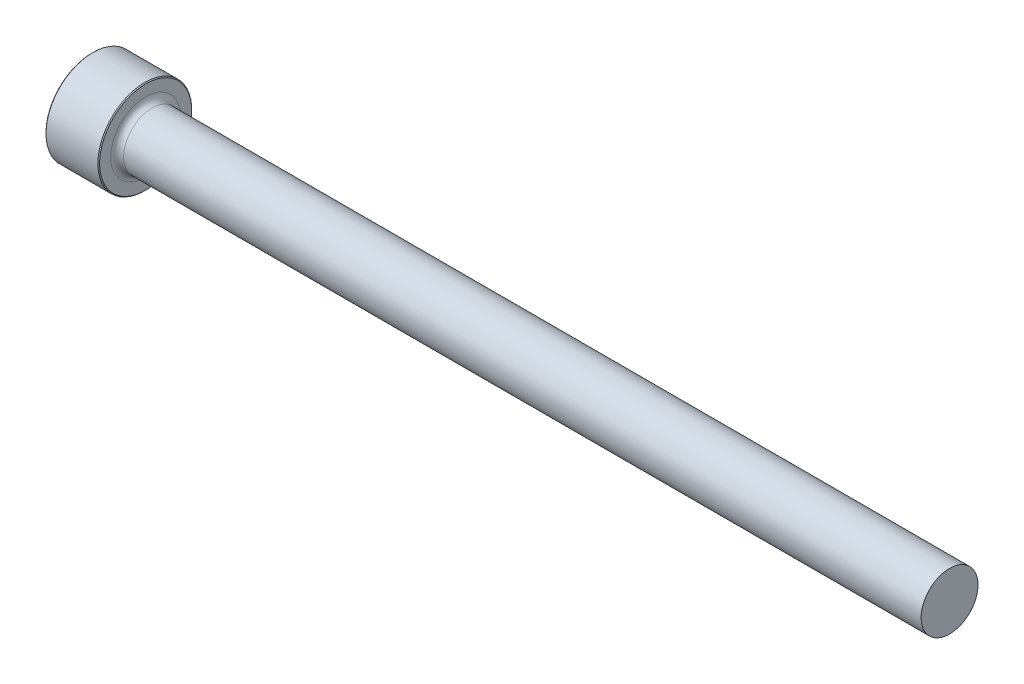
from build123d import *

# Parameters (mm, degrees)
CHAMFER1_SIZE = 0.1016


with BuildPart() as part:
    # Sketch1 → Revolve1 (revolve)
    with BuildSketch(Plane.XY):
        with BuildLine():
            Line((0, 0), (0, 5.55625))
            Line((0, 5.55625), (6.35, 5.55625))
            Line((6.35, 5.55625), (6.35, 4.1316275))
            ThreePointArc((6.35, 4.1316275), (6.573184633, 3.592812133), (7.112, 3.3696275))
            Line((7.112, 3.3696275), (101.6, 3.3696275))
            Line((101.6, 3.3696275), (101.6, 0))
            Line((101.6, 0), (0, 0))
        make_face()
    revolve(axis=Axis((101.6, 0, 0), (-1, 0, 0)))

    # Chamfer1
    chamfer1_edges = [part.edges().sort_by_distance(p)[0] for p in [
        (0, -5.55625, 0),
        (6.35, -5.55625, 0),
    ]]
    chamfer(chamfer1_edges, length=CHAMFER1_SIZE)


solid = part.part
